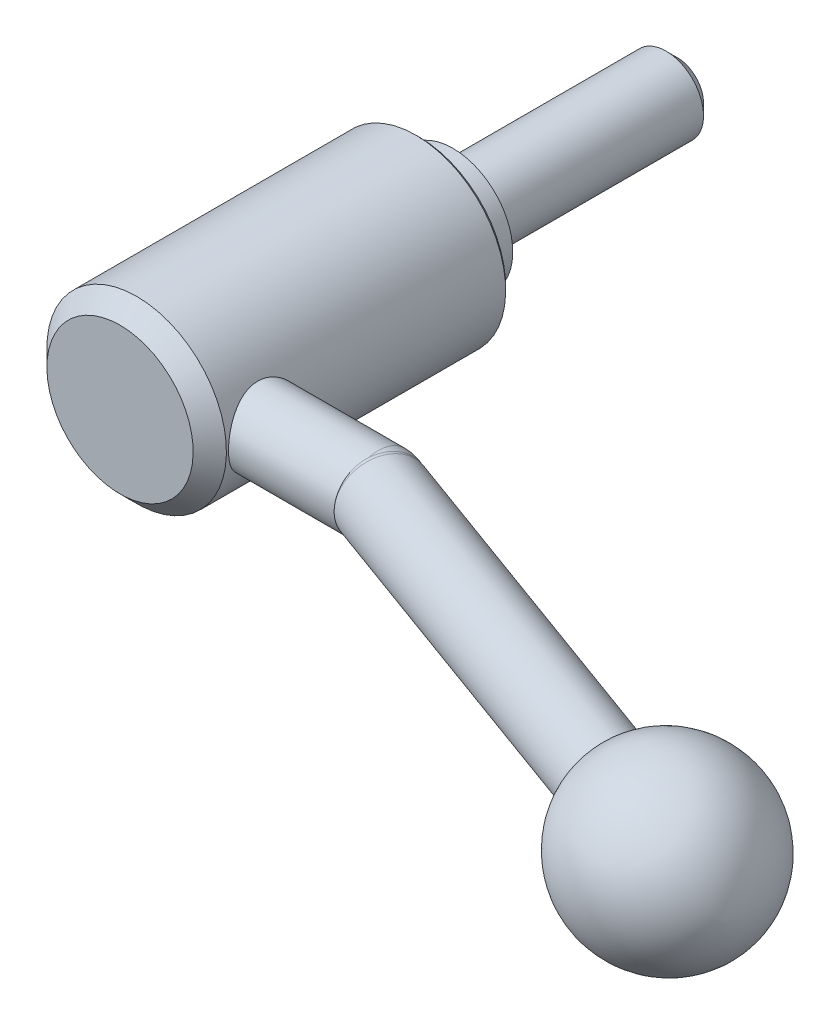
ISO-10303-21;
HEADER;
FILE_DESCRIPTION(('STEP AP214'),'2;1');
FILE_NAME('part.step','',(''),(''),'','','');
FILE_SCHEMA(('AUTOMOTIVE_DESIGN { 1 0 10303 214 1 1 1 1 }'));
ENDSEC;
DATA;
#1=APPLICATION_CONTEXT('core data for automotive mechanical design processes');
#2=APPLICATION_PROTOCOL_DEFINITION('international standard','automotive_design',2000,#1);
#3=PRODUCT_CONTEXT('',#1,'mechanical');
#4=PRODUCT('Part','Part','',(#3));
#5=PRODUCT_RELATED_PRODUCT_CATEGORY('part','',(#4));
#6=PRODUCT_DEFINITION_FORMATION('','',#4);
#7=PRODUCT_DEFINITION_CONTEXT('part definition',#1,'design');
#8=PRODUCT_DEFINITION('design','',#6,#7);
#9=PRODUCT_DEFINITION_SHAPE('','',#8);
#10=(LENGTH_UNIT() NAMED_UNIT(*) SI_UNIT(.MILLI.,.METRE.));
#11=(NAMED_UNIT(*) PLANE_ANGLE_UNIT() SI_UNIT($,.RADIAN.));
#12=(NAMED_UNIT(*) SI_UNIT($,.STERADIAN.) SOLID_ANGLE_UNIT());
#13=UNCERTAINTY_MEASURE_WITH_UNIT(LENGTH_MEASURE(1.E-05),#10,'distance_accuracy_value','');
#14=(GEOMETRIC_REPRESENTATION_CONTEXT(3) GLOBAL_UNCERTAINTY_ASSIGNED_CONTEXT((#13)) GLOBAL_UNIT_ASSIGNED_CONTEXT((#10,
#11,#12)) REPRESENTATION_CONTEXT('',''));
#15=CARTESIAN_POINT('',(0.,0.,0.));
#16=DIRECTION('',(0.,0.,1.));
#17=DIRECTION('',(1.,0.,0.));
#18=AXIS2_PLACEMENT_3D('',#15,#16,#17);
#19=CARTESIAN_POINT('',(0.,0.,0.));
#20=DIRECTION('',(0.,0.,-1.));
#21=DIRECTION('',(0.,1.,0.));
#22=AXIS2_PLACEMENT_3D('',#19,#20,#21);
#23=CYLINDRICAL_SURFACE('',#22,12.);
#24=CARTESIAN_POINT('',(0.,0.,4.95));
#25=DIRECTION('',(0.,0.,-1.));
#26=DIRECTION('',(0.,1.,0.));
#27=AXIS2_PLACEMENT_3D('',#24,#25,#26);
#28=CIRCLE('',#27,12.);
#29=CARTESIAN_POINT('',(0.,12.,4.95));
#30=VERTEX_POINT('',#29);
#31=EDGE_CURVE('E147',#30,#30,#28,.T.);
#32=ORIENTED_EDGE('',*,*,#31,.F.);
#33=EDGE_LOOP('',(#32));
#34=FACE_BOUND('',#33,.T.);
#35=CARTESIAN_POINT('',(10.9087121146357,5.,37.));
#36=CARTESIAN_POINT('',(10.9087130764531,4.99999907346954,37.1334013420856));
#37=CARTESIAN_POINT('',(10.9111675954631,4.99465346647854,37.266850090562));
#38=CARTESIAN_POINT('',(10.9209052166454,4.97332510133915,37.5327768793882));
#39=CARTESIAN_POINT('',(10.9281914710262,4.95733539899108,37.6652542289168));
#40=CARTESIAN_POINT('',(10.94736464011,4.91485001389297,37.928469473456));
#41=CARTESIAN_POINT('',(10.9592613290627,4.88833200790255,38.0592030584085));
#42=CARTESIAN_POINT('',(10.9872633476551,4.82506361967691,38.3177583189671));
#43=CARTESIAN_POINT('',(11.0033704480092,4.7883089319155,38.4455787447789));
#44=CARTESIAN_POINT('',(11.0391992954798,4.7051161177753,38.6968536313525));
#45=CARTESIAN_POINT('',(11.0589043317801,4.65872262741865,38.8203252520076));
#46=CARTESIAN_POINT('',(11.1013893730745,4.5565572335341,39.062794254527));
#47=CARTESIAN_POINT('',(11.1241705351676,4.5007817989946,39.1817899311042));
#48=CARTESIAN_POINT('',(11.1961478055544,4.3200790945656,39.5308988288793));
#49=CARTESIAN_POINT('',(11.2490254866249,4.18166963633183,39.7534507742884));
#50=CARTESIAN_POINT('',(11.3622340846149,3.86388960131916,40.185337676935));
#51=CARTESIAN_POINT('',(11.4228172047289,3.68264836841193,40.3932181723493));
#52=CARTESIAN_POINT('',(11.5425773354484,3.28805127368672,40.7768129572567));
#53=CARTESIAN_POINT('',(11.6017537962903,3.07468308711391,40.9525148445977));
#54=CARTESIAN_POINT('',(11.6861172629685,2.72939811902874,41.1918033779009));
#55=CARTESIAN_POINT('',(11.7140370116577,2.60726265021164,41.2688525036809));
#56=CARTESIAN_POINT('',(11.7670757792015,2.35633907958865,41.4123143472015));
#57=CARTESIAN_POINT('',(11.7921959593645,2.22755376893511,41.4787314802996));
#58=CARTESIAN_POINT('',(11.838917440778,1.96416180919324,41.6003389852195));
#59=CARTESIAN_POINT('',(11.8605184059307,1.82955460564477,41.6555282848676));
#60=CARTESIAN_POINT('',(11.8995529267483,1.55556138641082,41.7540939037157));
#61=CARTESIAN_POINT('',(11.9169885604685,1.41617779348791,41.7974761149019));
#62=CARTESIAN_POINT('',(11.9463943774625,1.14097065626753,41.8700493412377));
#63=CARTESIAN_POINT('',(11.9586002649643,1.00533485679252,41.8998574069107));
#64=CARTESIAN_POINT('',(11.978450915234,0.731783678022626,41.9481078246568));
#65=CARTESIAN_POINT('',(11.9860977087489,0.593869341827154,41.9665552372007));
#66=CARTESIAN_POINT('',(11.9966178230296,0.316820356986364,41.9918906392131));
#67=CARTESIAN_POINT('',(11.9994918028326,0.177685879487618,41.998780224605));
#68=CARTESIAN_POINT('',(12.0003846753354,-0.100685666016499,42.0009233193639));
#69=CARTESIAN_POINT('',(11.9984037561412,-0.239922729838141,41.9961772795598));
#70=CARTESIAN_POINT('',(11.9899136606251,-0.508875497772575,41.9757519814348));
#71=CARTESIAN_POINT('',(11.9836886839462,-0.638652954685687,41.9607587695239));
#72=CARTESIAN_POINT('',(11.9671679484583,-0.896425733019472,41.9207154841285));
#73=CARTESIAN_POINT('',(11.9568708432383,-1.02442045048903,41.8956620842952));
#74=CARTESIAN_POINT('',(11.9324642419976,-1.27768058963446,41.8357474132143));
#75=CARTESIAN_POINT('',(11.9183560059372,-1.40294689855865,41.8008893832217));
#76=CARTESIAN_POINT('',(11.8866740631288,-1.65000960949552,41.7216867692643));
#77=CARTESIAN_POINT('',(11.8690990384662,-1.77180467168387,41.6773385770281));
#78=CARTESIAN_POINT('',(11.8112061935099,-2.1344060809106,41.5291317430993));
#79=CARTESIAN_POINT('',(11.7660875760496,-2.36878813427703,41.4109765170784));
#80=CARTESIAN_POINT('',(11.6674248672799,-2.81488765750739,41.1406025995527));
#81=CARTESIAN_POINT('',(11.6138778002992,-3.02659707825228,40.9883718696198));
#82=CARTESIAN_POINT('',(11.4992708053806,-3.4373466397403,40.6416848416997));
#83=CARTESIAN_POINT('',(11.4379473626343,-3.6344418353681,40.4450085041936));
#84=CARTESIAN_POINT('',(11.317506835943,-3.9937495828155,40.0211105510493));
#85=CARTESIAN_POINT('',(11.2583906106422,-4.15594867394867,39.7938772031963));
#86=CARTESIAN_POINT('',(11.1754830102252,-4.37204843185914,39.4302315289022));
#87=CARTESIAN_POINT('',(11.1484199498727,-4.44042007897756,39.3029580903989));
#88=CARTESIAN_POINT('',(11.0975376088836,-4.5660982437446,39.0424564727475));
#89=CARTESIAN_POINT('',(11.0737170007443,-4.62340929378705,38.9092307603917));
#90=CARTESIAN_POINT('',(11.0301558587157,-4.72639308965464,38.6377673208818));
#91=CARTESIAN_POINT('',(11.010413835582,-4.77207008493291,38.4995314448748));
#92=CARTESIAN_POINT('',(10.9757324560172,-4.85130620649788,38.219039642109));
#93=CARTESIAN_POINT('',(10.9607926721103,-4.88486641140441,38.0767840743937));
#94=CARTESIAN_POINT('',(10.9370969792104,-4.93768074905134,37.7987576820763));
#95=CARTESIAN_POINT('',(10.9280027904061,-4.95772169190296,37.6631648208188));
#96=CARTESIAN_POINT('',(10.9148523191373,-4.9866073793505,37.3905520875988));
#97=CARTESIAN_POINT('',(10.9107956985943,-4.99545287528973,37.2535323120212));
#98=CARTESIAN_POINT('',(10.9078699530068,-5.00183821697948,36.9792139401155));
#99=CARTESIAN_POINT('',(10.9089993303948,-4.9993813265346,36.8419154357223));
#100=CARTESIAN_POINT('',(10.9163998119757,-4.98320111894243,36.5681288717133));
#101=CARTESIAN_POINT('',(10.9226707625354,-4.96947813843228,36.4316407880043));
#102=CARTESIAN_POINT('',(10.939564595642,-4.93217158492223,36.1692842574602));
#103=CARTESIAN_POINT('',(10.9498816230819,-4.90927900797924,36.0432974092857));
#104=CARTESIAN_POINT('',(10.9744912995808,-4.85401305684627,35.7938045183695));
#105=CARTESIAN_POINT('',(10.9887852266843,-4.82163663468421,35.6702992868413));
#106=CARTESIAN_POINT('',(11.0370194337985,-4.71071065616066,35.3047320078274));
#107=CARTESIAN_POINT('',(11.0763259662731,-4.6183356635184,35.0674195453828));
#108=CARTESIAN_POINT('',(11.1668340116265,-4.39509042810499,34.6014982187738));
#109=CARTESIAN_POINT('',(11.2184687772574,-4.26275559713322,34.3736835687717));
#110=CARTESIAN_POINT('',(11.3271978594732,-3.9648148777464,33.9423843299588));
#111=CARTESIAN_POINT('',(11.3842945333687,-3.79919458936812,33.7389103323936));
#112=CARTESIAN_POINT('',(11.5031524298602,-3.42333828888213,33.344771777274));
#113=CARTESIAN_POINT('',(11.5649149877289,-3.21056780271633,33.1564985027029));
#114=CARTESIAN_POINT('',(11.652539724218,-2.86918502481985,32.9026870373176));
#115=CARTESIAN_POINT('',(11.6809270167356,-2.75160882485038,32.8228101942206));
#116=CARTESIAN_POINT('',(11.7352796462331,-2.50969002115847,32.6731475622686));
#117=CARTESIAN_POINT('',(11.761246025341,-2.38535036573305,32.6033574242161));
#118=CARTESIAN_POINT('',(11.8101156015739,-2.13027929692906,32.4742500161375));
#119=CARTESIAN_POINT('',(11.8330091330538,-1.99952940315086,32.4149656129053));
#120=CARTESIAN_POINT('',(11.8749794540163,-1.73293321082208,32.3077113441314));
#121=CARTESIAN_POINT('',(11.8940578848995,-1.59708913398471,32.2597366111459));
#122=CARTESIAN_POINT('',(11.9278439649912,-1.32129951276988,32.1755883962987));
#123=CARTESIAN_POINT('',(11.9425527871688,-1.18135508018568,32.1394117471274));
#124=CARTESIAN_POINT('',(11.9671605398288,-0.89845467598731,32.0792595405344));
#125=CARTESIAN_POINT('',(11.9770598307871,-0.75549893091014,32.0552830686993));
#126=CARTESIAN_POINT('',(11.9912289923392,-0.477883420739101,32.021064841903));
#127=CARTESIAN_POINT('',(11.9958449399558,-0.343344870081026,32.0099778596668));
#128=CARTESIAN_POINT('',(12.0005316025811,-0.073683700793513,31.9987215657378));
#129=CARTESIAN_POINT('',(12.0006007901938,0.0614390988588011,31.9985559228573));
#130=CARTESIAN_POINT('',(11.9961887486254,0.331106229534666,32.0091516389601));
#131=CARTESIAN_POINT('',(11.9917099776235,0.465650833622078,32.0199070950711));
#132=CARTESIAN_POINT('',(11.9783256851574,0.733261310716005,32.0522225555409));
#133=CARTESIAN_POINT('',(11.9694185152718,0.866326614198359,32.0737865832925));
#134=CARTESIAN_POINT('',(11.9478093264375,1.12521434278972,32.1265303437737));
#135=CARTESIAN_POINT('',(11.9352551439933,1.25112522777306,32.1573367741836));
#136=CARTESIAN_POINT('',(11.9065633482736,1.49981842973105,32.2284909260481));
#137=CARTESIAN_POINT('',(11.8904244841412,1.62259963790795,32.2688419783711));
#138=CARTESIAN_POINT('',(11.8371898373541,1.98503132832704,32.403699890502));
#139=CARTESIAN_POINT('',(11.7952573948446,2.21898154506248,32.5120551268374));
#140=CARTESIAN_POINT('',(11.700229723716,2.67613896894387,32.7679713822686));
#141=CARTESIAN_POINT('',(11.6467156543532,2.8983828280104,32.9170829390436));
#142=CARTESIAN_POINT('',(11.5348651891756,3.31565850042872,33.248014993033));
#143=CARTESIAN_POINT('',(11.4765270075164,3.51068016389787,33.4298476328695));
#144=CARTESIAN_POINT('',(11.3565857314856,3.88182487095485,33.835823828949));
#145=CARTESIAN_POINT('',(11.2950305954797,4.05575892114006,34.0620045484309));
#146=CARTESIAN_POINT('',(11.2086213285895,4.28644220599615,34.4218577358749));
#147=CARTESIAN_POINT('',(11.1807840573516,4.35834922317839,34.5453544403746));
#148=CARTESIAN_POINT('',(11.1279493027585,4.49153302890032,34.7985115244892));
#149=CARTESIAN_POINT('',(11.1029505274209,4.55281466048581,34.9281690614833));
#150=CARTESIAN_POINT('',(11.0567342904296,4.66392927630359,35.1921877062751));
#151=CARTESIAN_POINT('',(11.0354990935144,4.7138162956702,35.3265229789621));
#152=CARTESIAN_POINT('',(10.9974167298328,4.80199267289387,35.599492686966));
#153=CARTESIAN_POINT('',(10.9805674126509,4.84028771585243,35.7381249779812));
#154=CARTESIAN_POINT('',(10.9519122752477,4.90477948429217,36.0182918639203));
#155=CARTESIAN_POINT('',(10.9400931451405,4.93100815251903,36.1598177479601));
#156=CARTESIAN_POINT('',(10.9219030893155,4.97116941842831,36.4448760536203));
#157=CARTESIAN_POINT('',(10.9155279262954,4.98511157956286,36.5884068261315));
#158=CARTESIAN_POINT('',(10.9109028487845,4.99521783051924,36.7768518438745));
#159=CARTESIAN_POINT('',(10.9100818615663,4.99701063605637,36.8214567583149));
#160=CARTESIAN_POINT('',(10.9089863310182,4.99940188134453,36.9107060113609));
#161=CARTESIAN_POINT('',(10.9087117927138,5.00000031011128,36.9553503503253));
#162=CARTESIAN_POINT('',(10.9087121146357,5.,37.));
#163=B_SPLINE_CURVE_WITH_KNOTS('',3,(#35,#36,#37,#38,#39,#40,#41,#42,#43,#44,#45,#46,#47,#48,
#49,#50,#51,#52,#53,#54,#55,#56,#57,#58,#59,#60,#61,#62,#63,#64,#65,#66,#67,#68,#69,#70,#71,#72,
#73,#74,#75,#76,#77,#78,#79,#80,#81,#82,#83,#84,#85,#86,#87,#88,#89,#90,#91,#92,#93,#94,#95,#96,
#97,#98,#99,#100,#101,#102,#103,#104,#105,#106,#107,#108,#109,#110,#111,#112,#113,#114,#115,
#116,#117,#118,#119,#120,#121,#122,#123,#124,#125,#126,#127,#128,#129,#130,#131,#132,#133,#134,
#135,#136,#137,#138,#139,#140,#141,#142,#143,#144,#145,#146,#147,#148,#149,#150,#151,#152,#153,
#154,#155,#156,#157,#158,#159,#160,#161,#162),.UNSPECIFIED.,.T.,.F.,(4,2,2,2,2,2,2,2,2,2,2,2,2,
2,2,2,2,2,2,2,2,2,2,2,2,2,2,2,2,2,2,2,2,2,2,2,2,2,2,2,2,2,2,2,2,2,2,2,2,2,2,2,2,2,2,2,2,2,2,2,2,
2,2,4),(0.,0.400157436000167,0.800576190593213,1.20184852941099,1.60328989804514,
2.00291210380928,2.40268505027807,3.20123019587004,4.04483609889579,4.88876646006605,
5.32954710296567,5.77014421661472,6.21078338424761,6.65120225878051,7.06888225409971,
7.48637606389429,7.90381222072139,8.32123220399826,8.71313663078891,9.10517074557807,
9.49707541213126,9.88912935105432,10.6843842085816,11.4799204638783,12.3315328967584,
13.1834732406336,13.6239634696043,14.064272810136,14.5044210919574,14.9445301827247,
15.3560893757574,15.7676209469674,16.1790336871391,16.5904341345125,16.9753736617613,
17.3604370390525,18.129966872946,18.9320860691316,19.7345530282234,20.6023475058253,
21.0367677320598,21.4710000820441,21.9065678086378,22.3419477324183,22.7772106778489,
23.2124409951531,23.6171514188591,24.0219977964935,24.4266254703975,24.8314038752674,
25.2216396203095,25.6120117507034,26.3921129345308,27.2074696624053,28.0231295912,
28.8942922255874,29.3306260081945,29.7667603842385,30.2007814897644,30.6345893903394,
31.067242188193,31.4995579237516,31.6334900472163,31.7674234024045),.UNSPECIFIED.);
#164=CARTESIAN_POINT('',(10.9087121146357,5.,37.));
#165=VERTEX_POINT('',#164);
#166=EDGE_CURVE('E77',#165,#165,#163,.T.);
#167=ORIENTED_EDGE('',*,*,#166,.F.);
#168=EDGE_LOOP('',(#167));
#169=FACE_BOUND('',#168,.T.);
#170=CARTESIAN_POINT('',(0.,0.,42.275));
#171=DIRECTION('',(0.,0.,-1.));
#172=DIRECTION('',(0.,1.,0.));
#173=AXIS2_PLACEMENT_3D('',#170,#171,#172);
#174=CIRCLE('',#173,12.);
#175=CARTESIAN_POINT('',(0.,12.,42.275));
#176=VERTEX_POINT('',#175);
#177=EDGE_CURVE('E149',#176,#176,#174,.T.);
#178=ORIENTED_EDGE('',*,*,#177,.T.);
#179=EDGE_LOOP('',(#178));
#180=FACE_BOUND('',#179,.T.);
#181=ADVANCED_FACE('F14',(#34,#169,#180),#23,.T.);
#182=CARTESIAN_POINT('',(0.,0.,44.5));
#183=DIRECTION('',(0.,0.,-1.));
#184=DIRECTION('',(0.,1.,0.));
#185=AXIS2_PLACEMENT_3D('',#182,#183,#184);
#186=PLANE('',#185);
#187=CARTESIAN_POINT('',(0.,0.,44.5));
#188=DIRECTION('',(0.,0.,-1.));
#189=DIRECTION('',(0.,1.,0.));
#190=AXIS2_PLACEMENT_3D('',#187,#188,#189);
#191=CIRCLE('',#190,9.775);
#192=CARTESIAN_POINT('',(0.,9.775,44.5));
#193=VERTEX_POINT('',#192);
#194=EDGE_CURVE('E85',#193,#193,#191,.T.);
#195=ORIENTED_EDGE('',*,*,#194,.F.);
#196=EDGE_LOOP('',(#195));
#197=FACE_BOUND('',#196,.T.);
#198=ADVANCED_FACE('F61',(#197),#186,.F.);
#199=CARTESIAN_POINT('',(0.,0.,44.5));
#200=DIRECTION('',(0.,0.,-1.));
#201=DIRECTION('',(0.,1.,0.));
#202=AXIS2_PLACEMENT_3D('',#199,#200,#201);
#203=CONICAL_SURFACE('',#202,9.775,0.785398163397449);
#204=ORIENTED_EDGE('',*,*,#177,.F.);
#205=EDGE_LOOP('',(#204));
#206=FACE_BOUND('',#205,.T.);
#207=ORIENTED_EDGE('',*,*,#194,.T.);
#208=EDGE_LOOP('',(#207));
#209=FACE_BOUND('',#208,.T.);
#210=ADVANCED_FACE('F67',(#206,#209),#203,.T.);
#211=CARTESIAN_POINT('',(0.,0.,4.95));
#212=DIRECTION('',(0.,0.,1.));
#213=DIRECTION('',(0.,-1.,0.));
#214=AXIS2_PLACEMENT_3D('',#211,#212,#213);
#215=CONICAL_SURFACE('',#214,12.,0.785398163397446);
#216=CARTESIAN_POINT('',(0.,0.,4.5));
#217=DIRECTION('',(0.,0.,-1.));
#218=DIRECTION('',(0.,1.,0.));
#219=AXIS2_PLACEMENT_3D('',#216,#217,#218);
#220=CIRCLE('',#219,11.55);
#221=CARTESIAN_POINT('',(0.,11.55,4.5));
#222=VERTEX_POINT('',#221);
#223=EDGE_CURVE('E142',#222,#222,#220,.T.);
#224=ORIENTED_EDGE('',*,*,#223,.F.);
#225=EDGE_LOOP('',(#224));
#226=FACE_BOUND('',#225,.T.);
#227=ORIENTED_EDGE('',*,*,#31,.T.);
#228=EDGE_LOOP('',(#227));
#229=FACE_BOUND('',#228,.T.);
#230=ADVANCED_FACE('F74',(#226,#229),#215,.T.);
#231=CARTESIAN_POINT('',(11.55,0.,4.5));
#232=DIRECTION('',(0.,0.,1.));
#233=DIRECTION('',(0.,-1.,0.));
#234=AXIS2_PLACEMENT_3D('',#231,#232,#233);
#235=PLANE('',#234);
#236=CARTESIAN_POINT('',(0.,0.,4.5));
#237=DIRECTION('',(0.,0.,-1.));
#238=DIRECTION('',(0.,1.,0.));
#239=AXIS2_PLACEMENT_3D('',#236,#237,#238);
#240=CIRCLE('',#239,8.);
#241=CARTESIAN_POINT('',(0.,8.,4.5));
#242=VERTEX_POINT('',#241);
#243=EDGE_CURVE('E140',#242,#242,#240,.T.);
#244=ORIENTED_EDGE('',*,*,#243,.F.);
#245=EDGE_LOOP('',(#244));
#246=FACE_BOUND('',#245,.T.);
#247=ORIENTED_EDGE('',*,*,#223,.T.);
#248=EDGE_LOOP('',(#247));
#249=FACE_BOUND('',#248,.T.);
#250=ADVANCED_FACE('F161',(#246,#249),#235,.F.);
#251=CARTESIAN_POINT('',(0.,0.,0.));
#252=DIRECTION('',(0.,0.,-1.));
#253=DIRECTION('',(0.,1.,0.));
#254=AXIS2_PLACEMENT_3D('',#251,#252,#253);
#255=CYLINDRICAL_SURFACE('',#254,8.);
#256=CARTESIAN_POINT('',(0.,0.,0.));
#257=DIRECTION('',(0.,0.,-1.));
#258=DIRECTION('',(0.,1.,0.));
#259=AXIS2_PLACEMENT_3D('',#256,#257,#258);
#260=CIRCLE('',#259,8.);
#261=CARTESIAN_POINT('',(0.,8.,0.));
#262=VERTEX_POINT('',#261);
#263=EDGE_CURVE('E138',#262,#262,#260,.T.);
#264=ORIENTED_EDGE('',*,*,#263,.F.);
#265=EDGE_LOOP('',(#264));
#266=FACE_BOUND('',#265,.T.);
#267=ORIENTED_EDGE('',*,*,#243,.T.);
#268=EDGE_LOOP('',(#267));
#269=FACE_BOUND('',#268,.T.);
#270=ADVANCED_FACE('F135',(#266,#269),#255,.T.);
#271=CARTESIAN_POINT('',(8.,0.,0.));
#272=DIRECTION('',(0.,0.,1.));
#273=DIRECTION('',(0.,-1.,0.));
#274=AXIS2_PLACEMENT_3D('',#271,#272,#273);
#275=PLANE('',#274);
#276=CARTESIAN_POINT('',(0.,0.,0.));
#277=DIRECTION('',(0.,0.,-1.));
#278=DIRECTION('',(0.,1.,0.));
#279=AXIS2_PLACEMENT_3D('',#276,#277,#278);
#280=CIRCLE('',#279,5.);
#281=CARTESIAN_POINT('',(0.,5.,0.));
#282=VERTEX_POINT('',#281);
#283=EDGE_CURVE('E126',#282,#282,#280,.T.);
#284=ORIENTED_EDGE('',*,*,#283,.F.);
#285=EDGE_LOOP('',(#284));
#286=FACE_BOUND('',#285,.T.);
#287=ORIENTED_EDGE('',*,*,#263,.T.);
#288=EDGE_LOOP('',(#287));
#289=FACE_BOUND('',#288,.T.);
#290=ADVANCED_FACE('F93',(#286,#289),#275,.F.);
#291=CARTESIAN_POINT('',(32.,0.,37.));
#292=DIRECTION('',(1.,0.,0.));
#293=DIRECTION('',(0.,1.,0.));
#294=AXIS2_PLACEMENT_3D('',#291,#292,#293);
#295=CYLINDRICAL_SURFACE('',#294,5.);
#296=CARTESIAN_POINT('',(27.0002,-4.83117434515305,38.2883145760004));
#297=CARTESIAN_POINT('',(26.9771151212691,-4.81425533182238,38.3517716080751));
#298=CARTESIAN_POINT('',(26.9549711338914,-4.79599919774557,38.4151983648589));
#299=CARTESIAN_POINT('',(26.9123130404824,-4.75682023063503,38.5417664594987));
#300=CARTESIAN_POINT('',(26.8917987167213,-4.73589775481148,38.6049078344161));
#301=CARTESIAN_POINT('',(26.8323357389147,-4.66915958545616,38.7935221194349));
#302=CARTESIAN_POINT('',(26.7954419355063,-4.61935429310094,38.9182563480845));
#303=CARTESIAN_POINT('',(26.7260075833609,-4.50939025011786,39.1641477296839));
#304=CARTESIAN_POINT('',(26.69346300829,-4.4492411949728,39.2853081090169));
#305=CARTESIAN_POINT('',(26.631969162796,-4.3188661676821,39.5230484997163));
#306=CARTESIAN_POINT('',(26.6030201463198,-4.2486394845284,39.6396281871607));
#307=CARTESIAN_POINT('',(26.5482810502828,-4.09859694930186,39.8670626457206));
#308=CARTESIAN_POINT('',(26.5224880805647,-4.01879000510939,39.9779226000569));
#309=CARTESIAN_POINT('',(26.4737060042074,-3.85000176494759,40.1931483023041));
#310=CARTESIAN_POINT('',(26.4507179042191,-3.76101719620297,40.2975117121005));
#311=CARTESIAN_POINT('',(26.4073462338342,-3.57452106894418,40.4988018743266));
#312=CARTESIAN_POINT('',(26.3869613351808,-3.47701390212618,40.595732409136));
#313=CARTESIAN_POINT('',(26.3486169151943,-3.27404367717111,40.7814771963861));
#314=CARTESIAN_POINT('',(26.330658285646,-3.16857771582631,40.8702884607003));
#315=CARTESIAN_POINT('',(26.2968878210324,-2.94931894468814,41.0399164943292));
#316=CARTESIAN_POINT('',(26.2810998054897,-2.83545204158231,41.1206422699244));
#317=CARTESIAN_POINT('',(26.2517972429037,-2.60111411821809,41.2724351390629));
#318=CARTESIAN_POINT('',(26.2382835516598,-2.48064063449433,41.3434985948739));
#319=CARTESIAN_POINT('',(26.2134747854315,-2.23400638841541,41.4753507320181));
#320=CARTESIAN_POINT('',(26.2021792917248,-2.10784670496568,41.5361413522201));
#321=CARTESIAN_POINT('',(26.1817528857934,-1.850678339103,41.6469996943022));
#322=CARTESIAN_POINT('',(26.1726227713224,-1.71966789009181,41.6970634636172));
#323=CARTESIAN_POINT('',(26.1565659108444,-1.45489437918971,41.7856658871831));
#324=CARTESIAN_POINT('',(26.1496212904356,-1.32116370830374,41.8242978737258));
#325=CARTESIAN_POINT('',(26.1378073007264,-1.05084556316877,41.8903082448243));
#326=CARTESIAN_POINT('',(26.1329387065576,-0.914257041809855,41.9176824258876));
#327=CARTESIAN_POINT('',(26.121432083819,-0.501829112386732,41.9825129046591));
#328=CARTESIAN_POINT('',(26.1178737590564,-0.223000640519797,42.0027862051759));
#329=CARTESIAN_POINT('',(26.1189625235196,0.332703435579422,41.9966121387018));
#330=CARTESIAN_POINT('',(26.1235681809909,0.609581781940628,41.9704006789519));
#331=CARTESIAN_POINT('',(26.1365918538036,1.01839236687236,41.8971560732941));
#332=CARTESIAN_POINT('',(26.1419571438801,1.15365429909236,41.8670594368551));
#333=CARTESIAN_POINT('',(26.1547482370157,1.42110904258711,41.7957866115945));
#334=CARTESIAN_POINT('',(26.162173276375,1.55330297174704,41.7546145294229));
#335=CARTESIAN_POINT('',(26.1791117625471,1.81374291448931,41.661488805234));
#336=CARTESIAN_POINT('',(26.1886259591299,1.94198749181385,41.6095312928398));
#337=CARTESIAN_POINT('',(26.2097731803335,2.19354456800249,41.4952682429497));
#338=CARTESIAN_POINT('',(26.2214054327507,2.3168588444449,41.4329664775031));
#339=CARTESIAN_POINT('',(26.2468425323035,2.55777038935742,41.2984703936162));
#340=CARTESIAN_POINT('',(26.2606478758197,2.67536634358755,41.2262738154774));
#341=CARTESIAN_POINT('',(26.2904898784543,2.90395912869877,41.0725891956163));
#342=CARTESIAN_POINT('',(26.3065257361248,3.01495830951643,40.991104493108));
#343=CARTESIAN_POINT('',(26.3410146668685,3.23022663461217,40.8189957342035));
#344=CARTESIAN_POINT('',(26.3594803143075,3.33445623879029,40.7283247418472));
#345=CARTESIAN_POINT('',(26.3988776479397,3.53478388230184,40.5389677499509));
#346=CARTESIAN_POINT('',(26.4198084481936,3.63088482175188,40.440284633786));
#347=CARTESIAN_POINT('',(26.4643216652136,3.81440211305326,40.2356199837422));
#348=CARTESIAN_POINT('',(26.4879053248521,3.90181435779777,40.1296350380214));
#349=CARTESIAN_POINT('',(26.5379464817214,4.06730764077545,39.9113164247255));
#350=CARTESIAN_POINT('',(26.564402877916,4.14539223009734,39.7989851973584));
#351=CARTESIAN_POINT('',(26.6190846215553,4.28799916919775,39.5748364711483));
#352=CARTESIAN_POINT('',(26.6471479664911,4.35301377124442,39.463292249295));
#353=CARTESIAN_POINT('',(26.7066083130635,4.47390595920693,39.2362277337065));
#354=CARTESIAN_POINT('',(26.7380049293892,4.52978459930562,39.1207079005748));
#355=CARTESIAN_POINT('',(26.8047544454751,4.63216753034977,38.8866145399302));
#356=CARTESIAN_POINT('',(26.8401091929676,4.67866741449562,38.7680396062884));
#357=CARTESIAN_POINT('',(26.915981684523,4.76212497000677,38.529146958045));
#358=CARTESIAN_POINT('',(26.9565014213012,4.79907894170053,38.4088285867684));
#359=CARTESIAN_POINT('',(27.000199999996,4.8311743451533,38.2883145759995));
#360=B_SPLINE_CURVE_WITH_KNOTS('',3,(#296,#297,#298,#299,#300,#301,#302,#303,#304,#305,#306,
#307,#308,#309,#310,#311,#312,#313,#314,#315,#316,#317,#318,#319,#320,#321,#322,#323,#324,#325,
#326,#327,#328,#329,#330,#331,#332,#333,#334,#335,#336,#337,#338,#339,#340,#341,#342,#343,#344,
#345,#346,#347,#348,#349,#350,#351,#352,#353,#354,#355,#356,#357,#358,#359),.UNSPECIFIED.,.F.,
.F.,(4,2,2,2,2,2,2,2,2,2,2,2,2,2,2,2,2,2,2,2,2,2,2,2,2,2,2,2,2,2,2,4),(0.,0.208793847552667,
0.417559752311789,0.834859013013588,1.25176923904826,1.66870889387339,2.08526383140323,
2.50196783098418,2.91845835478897,3.33510154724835,3.75600341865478,4.17706331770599,
4.5980436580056,5.01917885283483,5.43677439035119,5.85452571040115,6.68900674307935,
7.51926494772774,7.93487433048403,8.35032982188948,8.76593465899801,9.18138827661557,
9.59693693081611,10.0123366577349,10.4299775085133,10.8474687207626,11.2651563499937,
11.6826844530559,12.078641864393,12.4745535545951,12.870650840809,13.2669014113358),.UNSPECIFIED.);
#361=CARTESIAN_POINT('',(27.,-4.83102779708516,38.2888640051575));
#362=VERTEX_POINT('',#361);
#363=CARTESIAN_POINT('',(26.1183650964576,0.,42.));
#364=VERTEX_POINT('',#363);
#365=EDGE_CURVE('E29',#362,#364,#360,.T.);
#366=ORIENTED_EDGE('',*,*,#365,.T.);
#367=CARTESIAN_POINT('',(27.,4.83102779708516,38.2888640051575));
#368=VERTEX_POINT('',#367);
#369=EDGE_CURVE('E98',#364,#368,#360,.T.);
#370=ORIENTED_EDGE('',*,*,#369,.T.);
#371=CARTESIAN_POINT('',(27.,0.,37.));
#372=DIRECTION('',(1.,0.,0.));
#373=DIRECTION('',(0.,1.,0.));
#374=AXIS2_PLACEMENT_3D('',#371,#372,#373);
#375=CIRCLE('',#374,5.);
#376=EDGE_CURVE('E107',#362,#368,#375,.T.);
#377=ORIENTED_EDGE('',*,*,#376,.F.);
#378=EDGE_LOOP('',(#366,#370,#377));
#379=FACE_BOUND('',#378,.T.);
#380=ORIENTED_EDGE('',*,*,#166,.T.);
#381=EDGE_LOOP('',(#380));
#382=FACE_BOUND('',#381,.T.);
#383=ADVANCED_FACE('F87',(#379,#382),#295,.T.);
#384=CARTESIAN_POINT('',(27.,0.,37.));
#385=DIRECTION('',(1.,0.,0.));
#386=DIRECTION('',(0.,0.,1.));
#387=AXIS2_PLACEMENT_3D('',#384,#385,#386);
#388=SPHERICAL_SURFACE('',#387,5.);
#389=CARTESIAN_POINT('',(27.4142329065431,0.,37.1507684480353));
#390=DIRECTION('',(0.939692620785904,0.,0.342020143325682));
#391=DIRECTION('',(-0.342020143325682,0.,0.939692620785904));
#392=AXIS2_PLACEMENT_3D('',#389,#390,#391);
#393=CIRCLE('',#392,4.98053008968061);
#394=EDGE_CURVE('E36',#362,#368,#393,.T.);
#395=ORIENTED_EDGE('',*,*,#394,.F.);
#396=ORIENTED_EDGE('',*,*,#376,.T.);
#397=EDGE_LOOP('',(#395,#396));
#398=FACE_BOUND('',#397,.T.);
#399=ADVANCED_FACE('F92',(#398),#388,.T.);
#400=CARTESIAN_POINT('',(27.828465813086,0.,37.3015368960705));
#401=DIRECTION('',(0.939692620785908,0.,0.342020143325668));
#402=DIRECTION('',(-0.342020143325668,0.,0.939692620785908));
#403=AXIS2_PLACEMENT_3D('',#400,#401,#402);
#404=SPHERICAL_SURFACE('',#403,5.);
#405=ORIENTED_EDGE('',*,*,#365,.F.);
#406=ORIENTED_EDGE('',*,*,#394,.T.);
#407=ORIENTED_EDGE('',*,*,#369,.F.);
#408=CARTESIAN_POINT('',(27.8284658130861,0.,37.3015368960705));
#409=DIRECTION('',(0.939692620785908,0.,0.342020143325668));
#410=DIRECTION('',(-0.342020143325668,0.,0.939692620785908));
#411=AXIS2_PLACEMENT_3D('',#408,#409,#410);
#412=CIRCLE('',#411,5.);
#413=EDGE_CURVE('E105',#364,#364,#412,.T.);
#414=ORIENTED_EDGE('',*,*,#413,.F.);
#415=EDGE_LOOP('',(#405,#406,#407,#414));
#416=FACE_BOUND('',#415,.T.);
#417=ADVANCED_FACE('F109',(#416),#404,.T.);
#418=CARTESIAN_POINT('',(99.5041035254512,0.,63.3893355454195));
#419=DIRECTION('',(0.939692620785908,0.,0.342020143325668));
#420=DIRECTION('',(-0.342020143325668,0.,0.939692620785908));
#421=AXIS2_PLACEMENT_3D('',#418,#419,#420);
#422=CYLINDRICAL_SURFACE('',#421,5.);
#423=CARTESIAN_POINT('',(78.3773961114,0.,55.6998428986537));
#424=DIRECTION('',(0.939692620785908,0.,0.342020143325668));
#425=DIRECTION('',(-0.342020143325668,0.,0.939692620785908));
#426=AXIS2_PLACEMENT_3D('',#423,#424,#425);
#427=CIRCLE('',#426,5.);
#428=CARTESIAN_POINT('',(76.6672953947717,0.,60.3983060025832));
#429=VERTEX_POINT('',#428);
#430=EDGE_CURVE('E121',#429,#429,#427,.T.);
#431=ORIENTED_EDGE('',*,*,#430,.F.);
#432=EDGE_LOOP('',(#431));
#433=FACE_BOUND('',#432,.T.);
#434=ORIENTED_EDGE('',*,*,#413,.T.);
#435=EDGE_LOOP('',(#434));
#436=FACE_BOUND('',#435,.T.);
#437=ADVANCED_FACE('F56',(#433,#436),#422,.T.);
#438=CARTESIAN_POINT('',(76.6672953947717,0.,60.3983060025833));
#439=DIRECTION('',(0.939692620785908,0.,0.342020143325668));
#440=DIRECTION('',(-0.342020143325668,0.,0.939692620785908));
#441=AXIS2_PLACEMENT_3D('',#438,#439,#440);
#442=PLANE('',#441);
#443=CARTESIAN_POINT('',(78.3773961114,0.,55.6998428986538));
#444=DIRECTION('',(0.939692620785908,0.,0.342020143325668));
#445=DIRECTION('',(-0.342020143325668,0.,0.939692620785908));
#446=AXIS2_PLACEMENT_3D('',#443,#444,#445);
#447=CIRCLE('',#446,6.84016260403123);
#448=CARTESIAN_POINT('',(76.0379227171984,0.,62.1274932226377));
#449=VERTEX_POINT('',#448);
#450=EDGE_CURVE('E124',#449,#449,#447,.T.);
#451=ORIENTED_EDGE('',*,*,#450,.F.);
#452=EDGE_LOOP('',(#451));
#453=FACE_BOUND('',#452,.T.);
#454=ORIENTED_EDGE('',*,*,#430,.T.);
#455=EDGE_LOOP('',(#454));
#456=FACE_BOUND('',#455,.T.);
#457=ADVANCED_FACE('F45',(#453,#456),#442,.F.);
#458=CARTESIAN_POINT('',(88.,0.,58.5));
#459=DIRECTION('',(0.,0.999999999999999,0.));
#460=DIRECTION('',(-0.342020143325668,0.,0.939692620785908));
#461=AXIS2_PLACEMENT_3D('',#458,#459,#460);
#462=CIRCLE('',#461,12.5);
#463=TRIMMED_CURVE('',#462,(PARAMETER_VALUE(-1.51798478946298)),
(PARAMETER_VALUE(1.51798478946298)),.T.,.PARAMETER.);
#464=CARTESIAN_POINT('',(87.7743223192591,0.,59.1200443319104));
#465=DIRECTION('',(0.939692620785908,0.,0.342020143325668));
#466=AXIS1_PLACEMENT('',#464,#465);
#467=SURFACE_OF_REVOLUTION('',#463,#466);
#468=ORIENTED_EDGE('',*,*,#450,.T.);
#469=EDGE_LOOP('',(#468));
#470=FACE_BOUND('',#469,.T.);
#471=CARTESIAN_POINT('',(99.5041035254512,0.,63.3893355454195));
#472=VERTEX_POINT('',#471);
#473=VERTEX_LOOP('',#472);
#474=FACE_BOUND('',#473,.T.);
#475=ADVANCED_FACE('F42',(#470,#474),#467,.T.);
#476=CARTESIAN_POINT('',(0.,0.,14.));
#477=DIRECTION('',(0.,0.,-1.));
#478=DIRECTION('',(-1.,0.,0.));
#479=AXIS2_PLACEMENT_3D('',#476,#477,#478);
#480=CYLINDRICAL_SURFACE('',#479,5.);
#481=CARTESIAN_POINT('',(0.,0.,-28.5));
#482=DIRECTION('',(0.,0.,-1.));
#483=DIRECTION('',(-1.,0.,0.));
#484=AXIS2_PLACEMENT_3D('',#481,#482,#483);
#485=CIRCLE('',#484,5.);
#486=CARTESIAN_POINT('',(-5.,0.,-28.5));
#487=VERTEX_POINT('',#486);
#488=EDGE_CURVE('E9',#487,#487,#485,.F.);
#489=ORIENTED_EDGE('',*,*,#488,.T.);
#490=EDGE_LOOP('',(#489));
#491=FACE_BOUND('',#490,.T.);
#492=ORIENTED_EDGE('',*,*,#283,.T.);
#493=EDGE_LOOP('',(#492));
#494=FACE_BOUND('',#493,.T.);
#495=ADVANCED_FACE('F44',(#491,#494),#480,.T.);
#496=CARTESIAN_POINT('',(0.,0.,-30.));
#497=DIRECTION('',(0.,0.,-1.));
#498=DIRECTION('',(-1.,0.,0.));
#499=AXIS2_PLACEMENT_3D('',#496,#497,#498);
#500=PLANE('',#499);
#501=CARTESIAN_POINT('',(0.,0.,-30.));
#502=DIRECTION('',(0.,0.,-1.));
#503=DIRECTION('',(-1.,0.,0.));
#504=AXIS2_PLACEMENT_3D('',#501,#502,#503);
#505=CIRCLE('',#504,3.5);
#506=CARTESIAN_POINT('',(-3.5,0.,-30.));
#507=VERTEX_POINT('',#506);
#508=EDGE_CURVE('E22',#507,#507,#505,.T.);
#509=ORIENTED_EDGE('',*,*,#508,.T.);
#510=EDGE_LOOP('',(#509));
#511=FACE_BOUND('',#510,.T.);
#512=ADVANCED_FACE('F53',(#511),#500,.T.);
#513=CARTESIAN_POINT('',(0.,0.,-30.));
#514=DIRECTION('',(0.,0.,1.));
#515=DIRECTION('',(1.,0.,0.));
#516=AXIS2_PLACEMENT_3D('',#513,#514,#515);
#517=CONICAL_SURFACE('',#516,3.5,0.785398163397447);
#518=ORIENTED_EDGE('',*,*,#488,.F.);
#519=EDGE_LOOP('',(#518));
#520=FACE_BOUND('',#519,.T.);
#521=ORIENTED_EDGE('',*,*,#508,.F.);
#522=EDGE_LOOP('',(#521));
#523=FACE_BOUND('',#522,.T.);
#524=ADVANCED_FACE('F16',(#520,#523),#517,.T.);
#525=CLOSED_SHELL('',(#181,#198,#210,#230,#250,#270,#290,#383,#399,#417,#437,#457,#475,#495,
#512,#524));
#526=MANIFOLD_SOLID_BREP('B1',#525);
#527=ADVANCED_BREP_SHAPE_REPRESENTATION('',(#18,#526),#14);
#528=SHAPE_DEFINITION_REPRESENTATION(#9,#527);
ENDSEC;
END-ISO-10303-21;
